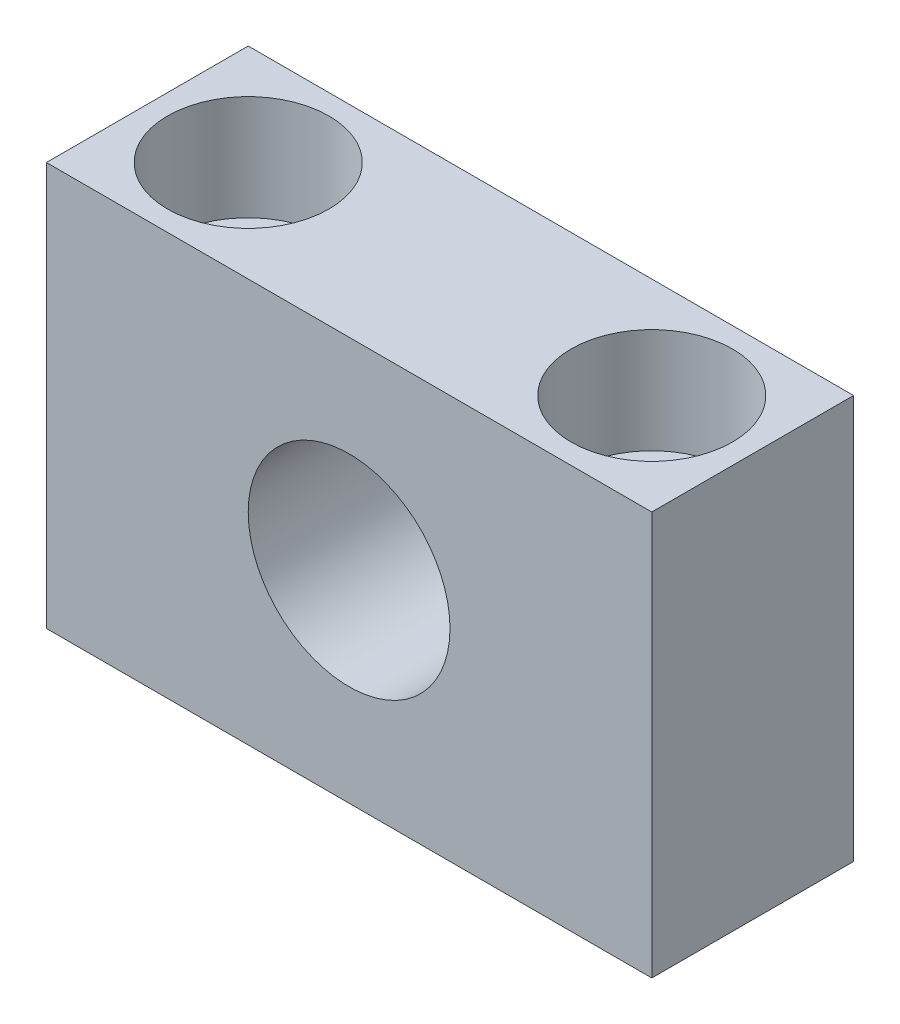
ISO-10303-21;
HEADER;
FILE_DESCRIPTION(('STEP AP214'),'2;1');
FILE_NAME('part.step','',(''),(''),'','','');
FILE_SCHEMA(('AUTOMOTIVE_DESIGN { 1 0 10303 214 1 1 1 1 }'));
ENDSEC;
DATA;
#1=APPLICATION_CONTEXT('core data for automotive mechanical design processes');
#2=APPLICATION_PROTOCOL_DEFINITION('international standard','automotive_design',2000,#1);
#3=PRODUCT_CONTEXT('',#1,'mechanical');
#4=PRODUCT('Part','Part','',(#3));
#5=PRODUCT_RELATED_PRODUCT_CATEGORY('part','',(#4));
#6=PRODUCT_DEFINITION_FORMATION('','',#4);
#7=PRODUCT_DEFINITION_CONTEXT('part definition',#1,'design');
#8=PRODUCT_DEFINITION('design','',#6,#7);
#9=PRODUCT_DEFINITION_SHAPE('','',#8);
#10=(LENGTH_UNIT() NAMED_UNIT(*) SI_UNIT(.MILLI.,.METRE.));
#11=(NAMED_UNIT(*) PLANE_ANGLE_UNIT() SI_UNIT($,.RADIAN.));
#12=(NAMED_UNIT(*) SI_UNIT($,.STERADIAN.) SOLID_ANGLE_UNIT());
#13=UNCERTAINTY_MEASURE_WITH_UNIT(LENGTH_MEASURE(1.E-05),#10,'distance_accuracy_value','');
#14=(GEOMETRIC_REPRESENTATION_CONTEXT(3) GLOBAL_UNCERTAINTY_ASSIGNED_CONTEXT((#13)) GLOBAL_UNIT_ASSIGNED_CONTEXT((#10,
#11,#12)) REPRESENTATION_CONTEXT('',''));
#15=CARTESIAN_POINT('',(0.,0.,0.));
#16=DIRECTION('',(0.,0.,1.));
#17=DIRECTION('',(1.,0.,0.));
#18=AXIS2_PLACEMENT_3D('',#15,#16,#17);
#19=CARTESIAN_POINT('',(0.,0.,25.));
#20=DIRECTION('',(0.,0.,1.));
#21=DIRECTION('',(1.,0.,0.));
#22=AXIS2_PLACEMENT_3D('',#19,#20,#21);
#23=PLANE('',#22);
#24=DIRECTION('',(0.,1.,0.));
#25=VECTOR('',#24,1.);
#26=CARTESIAN_POINT('',(37.5,25.,25.));
#27=LINE('',#26,#25);
#28=CARTESIAN_POINT('',(37.5,-25.,25.));
#29=VERTEX_POINT('',#28);
#30=CARTESIAN_POINT('',(37.5,25.,25.));
#31=VERTEX_POINT('',#30);
#32=EDGE_CURVE('E52',#29,#31,#27,.T.);
#33=ORIENTED_EDGE('',*,*,#32,.T.);
#34=DIRECTION('',(-1.,0.,0.));
#35=VECTOR('',#34,1.);
#36=CARTESIAN_POINT('',(-65.,25.,25.));
#37=LINE('',#36,#35);
#38=CARTESIAN_POINT('',(-37.5,25.,25.));
#39=VERTEX_POINT('',#38);
#40=EDGE_CURVE('E44',#31,#39,#37,.T.);
#41=ORIENTED_EDGE('',*,*,#40,.T.);
#42=DIRECTION('',(0.,-1.,0.));
#43=VECTOR('',#42,1.);
#44=CARTESIAN_POINT('',(-37.5,25.,25.));
#45=LINE('',#44,#43);
#46=CARTESIAN_POINT('',(-37.5,-25.,25.));
#47=VERTEX_POINT('',#46);
#48=EDGE_CURVE('E92',#39,#47,#45,.T.);
#49=ORIENTED_EDGE('',*,*,#48,.T.);
#50=DIRECTION('',(1.,0.,0.));
#51=VECTOR('',#50,1.);
#52=CARTESIAN_POINT('',(-65.,-25.,25.));
#53=LINE('',#52,#51);
#54=EDGE_CURVE('E12',#47,#29,#53,.T.);
#55=ORIENTED_EDGE('',*,*,#54,.T.);
#56=EDGE_LOOP('',(#33,#41,#49,#55));
#57=FACE_BOUND('',#56,.T.);
#58=CARTESIAN_POINT('',(0.,0.,25.));
#59=DIRECTION('',(0.,0.,1.));
#60=DIRECTION('',(1.,0.,0.));
#61=AXIS2_PLACEMENT_3D('',#58,#59,#60);
#62=CIRCLE('',#61,12.5);
#63=CARTESIAN_POINT('',(12.5,0.,25.));
#64=VERTEX_POINT('',#63);
#65=EDGE_CURVE('E101',#64,#64,#62,.T.);
#66=ORIENTED_EDGE('',*,*,#65,.F.);
#67=EDGE_LOOP('',(#66));
#68=FACE_BOUND('',#67,.T.);
#69=ADVANCED_FACE('F35',(#57,#68),#23,.T.);
#70=CARTESIAN_POINT('',(0.,0.,0.));
#71=DIRECTION('',(0.,0.,1.));
#72=DIRECTION('',(1.,0.,0.));
#73=AXIS2_PLACEMENT_3D('',#70,#71,#72);
#74=PLANE('',#73);
#75=DIRECTION('',(-1.,0.,0.));
#76=VECTOR('',#75,1.);
#77=CARTESIAN_POINT('',(-65.,25.,0.));
#78=LINE('',#77,#76);
#79=CARTESIAN_POINT('',(37.5,25.,0.));
#80=VERTEX_POINT('',#79);
#81=CARTESIAN_POINT('',(-37.5,25.,0.));
#82=VERTEX_POINT('',#81);
#83=EDGE_CURVE('E97',#80,#82,#78,.T.);
#84=ORIENTED_EDGE('',*,*,#83,.F.);
#85=DIRECTION('',(0.,1.,0.));
#86=VECTOR('',#85,1.);
#87=CARTESIAN_POINT('',(37.5,25.,0.));
#88=LINE('',#87,#86);
#89=CARTESIAN_POINT('',(37.5,-25.,0.));
#90=VERTEX_POINT('',#89);
#91=EDGE_CURVE('E79',#90,#80,#88,.T.);
#92=ORIENTED_EDGE('',*,*,#91,.F.);
#93=DIRECTION('',(1.,0.,0.));
#94=VECTOR('',#93,1.);
#95=CARTESIAN_POINT('',(-65.,-25.,0.));
#96=LINE('',#95,#94);
#97=CARTESIAN_POINT('',(-37.5,-25.,0.));
#98=VERTEX_POINT('',#97);
#99=EDGE_CURVE('E39',#98,#90,#96,.T.);
#100=ORIENTED_EDGE('',*,*,#99,.F.);
#101=DIRECTION('',(0.,-1.,0.));
#102=VECTOR('',#101,1.);
#103=CARTESIAN_POINT('',(-37.5,25.,0.));
#104=LINE('',#103,#102);
#105=EDGE_CURVE('E60',#82,#98,#104,.T.);
#106=ORIENTED_EDGE('',*,*,#105,.F.);
#107=EDGE_LOOP('',(#84,#92,#100,#106));
#108=FACE_BOUND('',#107,.T.);
#109=CARTESIAN_POINT('',(0.,0.,0.));
#110=DIRECTION('',(0.,0.,1.));
#111=DIRECTION('',(1.,0.,0.));
#112=AXIS2_PLACEMENT_3D('',#109,#110,#111);
#113=CIRCLE('',#112,12.5);
#114=CARTESIAN_POINT('',(12.5,0.,0.));
#115=VERTEX_POINT('',#114);
#116=EDGE_CURVE('E99',#115,#115,#113,.T.);
#117=ORIENTED_EDGE('',*,*,#116,.T.);
#118=EDGE_LOOP('',(#117));
#119=FACE_BOUND('',#118,.T.);
#120=ADVANCED_FACE('F141',(#108,#119),#74,.F.);
#121=CARTESIAN_POINT('',(-65.,25.,25.));
#122=DIRECTION('',(0.,-1.,0.));
#123=DIRECTION('',(0.,0.,-1.));
#124=AXIS2_PLACEMENT_3D('',#121,#122,#123);
#125=PLANE('',#124);
#126=CARTESIAN_POINT('',(-25.,25.,12.5));
#127=DIRECTION('',(0.,1.,0.));
#128=DIRECTION('',(0.,0.,1.));
#129=AXIS2_PLACEMENT_3D('',#126,#127,#128);
#130=CIRCLE('',#129,10.);
#131=CARTESIAN_POINT('',(-25.,25.,22.5));
#132=VERTEX_POINT('',#131);
#133=EDGE_CURVE('E84',#132,#132,#130,.T.);
#134=ORIENTED_EDGE('',*,*,#133,.F.);
#135=EDGE_LOOP('',(#134));
#136=FACE_BOUND('',#135,.T.);
#137=CARTESIAN_POINT('',(25.,25.,12.5));
#138=DIRECTION('',(0.,1.,0.));
#139=DIRECTION('',(0.,0.,1.));
#140=AXIS2_PLACEMENT_3D('',#137,#138,#139);
#141=CIRCLE('',#140,10.);
#142=CARTESIAN_POINT('',(25.,25.,22.5));
#143=VERTEX_POINT('',#142);
#144=EDGE_CURVE('E116',#143,#143,#141,.T.);
#145=ORIENTED_EDGE('',*,*,#144,.F.);
#146=EDGE_LOOP('',(#145));
#147=FACE_BOUND('',#146,.T.);
#148=ORIENTED_EDGE('',*,*,#40,.F.);
#149=DIRECTION('',(0.,0.,-1.));
#150=VECTOR('',#149,1.);
#151=CARTESIAN_POINT('',(37.5,25.,25.));
#152=LINE('',#151,#150);
#153=EDGE_CURVE('E76',#31,#80,#152,.T.);
#154=ORIENTED_EDGE('',*,*,#153,.T.);
#155=ORIENTED_EDGE('',*,*,#83,.T.);
#156=DIRECTION('',(0.,0.,-1.));
#157=VECTOR('',#156,1.);
#158=CARTESIAN_POINT('',(-37.5,25.,25.));
#159=LINE('',#158,#157);
#160=EDGE_CURVE('E85',#39,#82,#159,.T.);
#161=ORIENTED_EDGE('',*,*,#160,.F.);
#162=EDGE_LOOP('',(#148,#154,#155,#161));
#163=FACE_BOUND('',#162,.T.);
#164=ADVANCED_FACE('F37',(#136,#147,#163),#125,.F.);
#165=CARTESIAN_POINT('',(-65.,-25.,25.));
#166=DIRECTION('',(0.,1.,0.));
#167=DIRECTION('',(0.,0.,1.));
#168=AXIS2_PLACEMENT_3D('',#165,#166,#167);
#169=PLANE('',#168);
#170=CARTESIAN_POINT('',(-25.,-25.,12.5));
#171=DIRECTION('',(0.,1.,0.));
#172=DIRECTION('',(0.,0.,1.));
#173=AXIS2_PLACEMENT_3D('',#170,#171,#172);
#174=CIRCLE('',#173,6.74999999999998);
#175=CARTESIAN_POINT('',(-25.,-25.,19.25));
#176=VERTEX_POINT('',#175);
#177=EDGE_CURVE('E119',#176,#176,#174,.T.);
#178=ORIENTED_EDGE('',*,*,#177,.T.);
#179=EDGE_LOOP('',(#178));
#180=FACE_BOUND('',#179,.T.);
#181=CARTESIAN_POINT('',(25.,-25.,12.5));
#182=DIRECTION('',(0.,1.,0.));
#183=DIRECTION('',(0.,0.,1.));
#184=AXIS2_PLACEMENT_3D('',#181,#182,#183);
#185=CIRCLE('',#184,6.74999999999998);
#186=CARTESIAN_POINT('',(25.,-25.,19.25));
#187=VERTEX_POINT('',#186);
#188=EDGE_CURVE('E106',#187,#187,#185,.T.);
#189=ORIENTED_EDGE('',*,*,#188,.T.);
#190=EDGE_LOOP('',(#189));
#191=FACE_BOUND('',#190,.T.);
#192=ORIENTED_EDGE('',*,*,#99,.T.);
#193=DIRECTION('',(0.,0.,-1.));
#194=VECTOR('',#193,1.);
#195=CARTESIAN_POINT('',(37.5,-25.,25.));
#196=LINE('',#195,#194);
#197=EDGE_CURVE('E133',#29,#90,#196,.T.);
#198=ORIENTED_EDGE('',*,*,#197,.F.);
#199=ORIENTED_EDGE('',*,*,#54,.F.);
#200=DIRECTION('',(0.,0.,-1.));
#201=VECTOR('',#200,1.);
#202=CARTESIAN_POINT('',(-37.5,-25.,25.));
#203=LINE('',#202,#201);
#204=EDGE_CURVE('E131',#47,#98,#203,.T.);
#205=ORIENTED_EDGE('',*,*,#204,.T.);
#206=EDGE_LOOP('',(#192,#198,#199,#205));
#207=FACE_BOUND('',#206,.T.);
#208=ADVANCED_FACE('F138',(#180,#191,#207),#169,.F.);
#209=CARTESIAN_POINT('',(0.,0.,25.));
#210=DIRECTION('',(0.,0.,-1.));
#211=DIRECTION('',(-1.,0.,0.));
#212=AXIS2_PLACEMENT_3D('',#209,#210,#211);
#213=CYLINDRICAL_SURFACE('',#212,12.5);
#214=ORIENTED_EDGE('',*,*,#65,.T.);
#215=EDGE_LOOP('',(#214));
#216=FACE_BOUND('',#215,.T.);
#217=ORIENTED_EDGE('',*,*,#116,.F.);
#218=EDGE_LOOP('',(#217));
#219=FACE_BOUND('',#218,.T.);
#220=ADVANCED_FACE('F147',(#216,#219),#213,.F.);
#221=CARTESIAN_POINT('',(25.,25.,12.5));
#222=DIRECTION('',(0.,1.,0.));
#223=DIRECTION('',(0.,0.,1.));
#224=AXIS2_PLACEMENT_3D('',#221,#222,#223);
#225=CYLINDRICAL_SURFACE('',#224,6.74999999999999);
#226=ORIENTED_EDGE('',*,*,#188,.F.);
#227=EDGE_LOOP('',(#226));
#228=FACE_BOUND('',#227,.T.);
#229=CARTESIAN_POINT('',(25.,12.,12.5));
#230=DIRECTION('',(0.,1.,0.));
#231=DIRECTION('',(0.,0.,1.));
#232=AXIS2_PLACEMENT_3D('',#229,#230,#231);
#233=CIRCLE('',#232,6.75);
#234=CARTESIAN_POINT('',(25.,12.,19.25));
#235=VERTEX_POINT('',#234);
#236=EDGE_CURVE('E110',#235,#235,#233,.T.);
#237=ORIENTED_EDGE('',*,*,#236,.T.);
#238=EDGE_LOOP('',(#237));
#239=FACE_BOUND('',#238,.T.);
#240=ADVANCED_FACE('F149',(#228,#239),#225,.F.);
#241=CARTESIAN_POINT('',(31.75,12.,12.5));
#242=DIRECTION('',(0.,-1.,0.));
#243=DIRECTION('',(0.,0.,-1.));
#244=AXIS2_PLACEMENT_3D('',#241,#242,#243);
#245=PLANE('',#244);
#246=ORIENTED_EDGE('',*,*,#236,.F.);
#247=EDGE_LOOP('',(#246));
#248=FACE_BOUND('',#247,.T.);
#249=CARTESIAN_POINT('',(25.,12.,12.5));
#250=DIRECTION('',(0.,1.,0.));
#251=DIRECTION('',(0.,0.,1.));
#252=AXIS2_PLACEMENT_3D('',#249,#250,#251);
#253=CIRCLE('',#252,9.99999999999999);
#254=CARTESIAN_POINT('',(25.,12.,22.5));
#255=VERTEX_POINT('',#254);
#256=EDGE_CURVE('E113',#255,#255,#253,.T.);
#257=ORIENTED_EDGE('',*,*,#256,.T.);
#258=EDGE_LOOP('',(#257));
#259=FACE_BOUND('',#258,.T.);
#260=ADVANCED_FACE('F155',(#248,#259),#245,.F.);
#261=CARTESIAN_POINT('',(25.,25.,12.5));
#262=DIRECTION('',(0.,1.,0.));
#263=DIRECTION('',(0.,0.,1.));
#264=AXIS2_PLACEMENT_3D('',#261,#262,#263);
#265=CYLINDRICAL_SURFACE('',#264,10.);
#266=ORIENTED_EDGE('',*,*,#256,.F.);
#267=EDGE_LOOP('',(#266));
#268=FACE_BOUND('',#267,.T.);
#269=ORIENTED_EDGE('',*,*,#144,.T.);
#270=EDGE_LOOP('',(#269));
#271=FACE_BOUND('',#270,.T.);
#272=ADVANCED_FACE('F212',(#268,#271),#265,.F.);
#273=CARTESIAN_POINT('',(-25.,25.,12.5));
#274=DIRECTION('',(0.,1.,0.));
#275=DIRECTION('',(0.,0.,1.));
#276=AXIS2_PLACEMENT_3D('',#273,#274,#275);
#277=CYLINDRICAL_SURFACE('',#276,6.74999999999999);
#278=ORIENTED_EDGE('',*,*,#177,.F.);
#279=EDGE_LOOP('',(#278));
#280=FACE_BOUND('',#279,.T.);
#281=CARTESIAN_POINT('',(-25.,12.,12.5));
#282=DIRECTION('',(0.,1.,0.));
#283=DIRECTION('',(0.,0.,1.));
#284=AXIS2_PLACEMENT_3D('',#281,#282,#283);
#285=CIRCLE('',#284,6.75);
#286=CARTESIAN_POINT('',(-25.,12.,19.25));
#287=VERTEX_POINT('',#286);
#288=EDGE_CURVE('E122',#287,#287,#285,.T.);
#289=ORIENTED_EDGE('',*,*,#288,.T.);
#290=EDGE_LOOP('',(#289));
#291=FACE_BOUND('',#290,.T.);
#292=ADVANCED_FACE('F208',(#280,#291),#277,.F.);
#293=CARTESIAN_POINT('',(-18.25,12.,12.5));
#294=DIRECTION('',(0.,-1.,0.));
#295=DIRECTION('',(0.,0.,-1.));
#296=AXIS2_PLACEMENT_3D('',#293,#294,#295);
#297=PLANE('',#296);
#298=ORIENTED_EDGE('',*,*,#288,.F.);
#299=EDGE_LOOP('',(#298));
#300=FACE_BOUND('',#299,.T.);
#301=CARTESIAN_POINT('',(-25.,12.,12.5));
#302=DIRECTION('',(0.,1.,0.));
#303=DIRECTION('',(0.,0.,1.));
#304=AXIS2_PLACEMENT_3D('',#301,#302,#303);
#305=CIRCLE('',#304,10.);
#306=CARTESIAN_POINT('',(-25.,12.,22.5));
#307=VERTEX_POINT('',#306);
#308=EDGE_CURVE('E125',#307,#307,#305,.T.);
#309=ORIENTED_EDGE('',*,*,#308,.T.);
#310=EDGE_LOOP('',(#309));
#311=FACE_BOUND('',#310,.T.);
#312=ADVANCED_FACE('F204',(#300,#311),#297,.F.);
#313=CARTESIAN_POINT('',(-25.,25.,12.5));
#314=DIRECTION('',(0.,1.,0.));
#315=DIRECTION('',(0.,0.,1.));
#316=AXIS2_PLACEMENT_3D('',#313,#314,#315);
#317=CYLINDRICAL_SURFACE('',#316,10.);
#318=ORIENTED_EDGE('',*,*,#308,.F.);
#319=EDGE_LOOP('',(#318));
#320=FACE_BOUND('',#319,.T.);
#321=ORIENTED_EDGE('',*,*,#133,.T.);
#322=EDGE_LOOP('',(#321));
#323=FACE_BOUND('',#322,.T.);
#324=ADVANCED_FACE('F188',(#320,#323),#317,.F.);
#325=CARTESIAN_POINT('',(-37.5,25.,25.));
#326=DIRECTION('',(1.,0.,0.));
#327=DIRECTION('',(0.,0.,-1.));
#328=AXIS2_PLACEMENT_3D('',#325,#326,#327);
#329=PLANE('',#328);
#330=ORIENTED_EDGE('',*,*,#105,.T.);
#331=ORIENTED_EDGE('',*,*,#204,.F.);
#332=ORIENTED_EDGE('',*,*,#48,.F.);
#333=ORIENTED_EDGE('',*,*,#160,.T.);
#334=EDGE_LOOP('',(#330,#331,#332,#333));
#335=FACE_BOUND('',#334,.T.);
#336=ADVANCED_FACE('F183',(#335),#329,.F.);
#337=CARTESIAN_POINT('',(37.5,25.,25.));
#338=DIRECTION('',(-1.,0.,0.));
#339=DIRECTION('',(0.,0.,1.));
#340=AXIS2_PLACEMENT_3D('',#337,#338,#339);
#341=PLANE('',#340);
#342=ORIENTED_EDGE('',*,*,#91,.T.);
#343=ORIENTED_EDGE('',*,*,#153,.F.);
#344=ORIENTED_EDGE('',*,*,#32,.F.);
#345=ORIENTED_EDGE('',*,*,#197,.T.);
#346=EDGE_LOOP('',(#342,#343,#344,#345));
#347=FACE_BOUND('',#346,.T.);
#348=ADVANCED_FACE('F77',(#347),#341,.F.);
#349=CLOSED_SHELL('',(#69,#120,#164,#208,#220,#240,#260,#272,#292,#312,#324,#336,#348));
#350=MANIFOLD_SOLID_BREP('B2',#349);
#351=ADVANCED_BREP_SHAPE_REPRESENTATION('',(#18,#350),#14);
#352=SHAPE_DEFINITION_REPRESENTATION(#9,#351);
ENDSEC;
END-ISO-10303-21;
